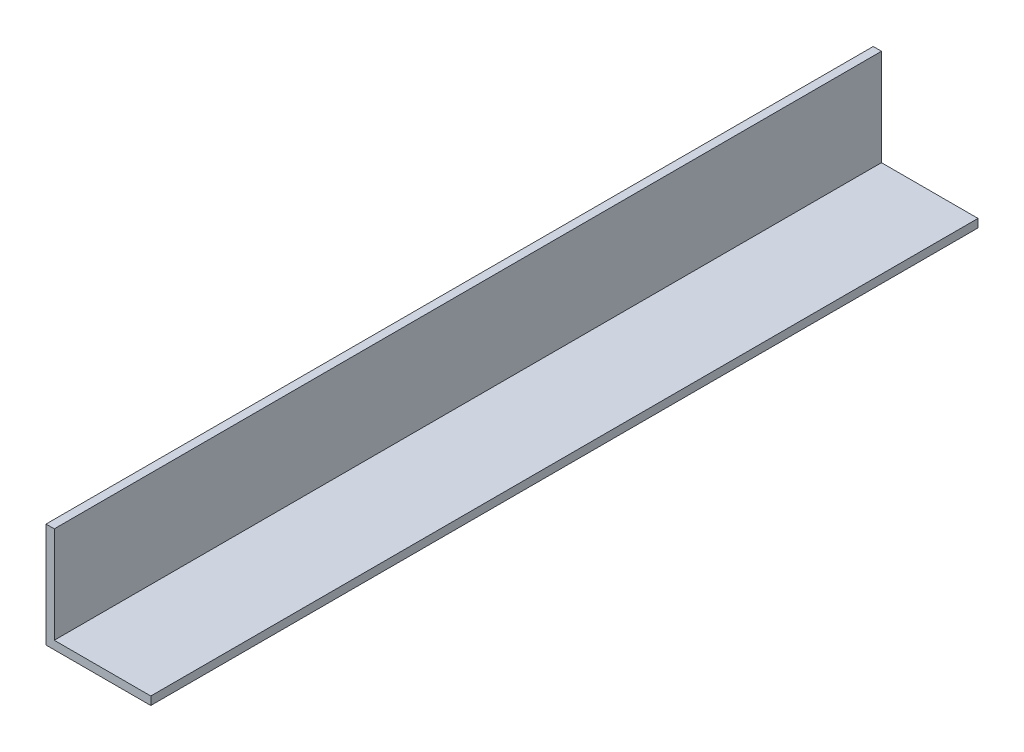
ISO-10303-21;
HEADER;
FILE_DESCRIPTION(('STEP AP214'),'2;1');
FILE_NAME('part.step','',(''),(''),'','','');
FILE_SCHEMA(('AUTOMOTIVE_DESIGN { 1 0 10303 214 1 1 1 1 }'));
ENDSEC;
DATA;
#1=APPLICATION_CONTEXT('core data for automotive mechanical design processes');
#2=APPLICATION_PROTOCOL_DEFINITION('international standard','automotive_design',2000,#1);
#3=PRODUCT_CONTEXT('',#1,'mechanical');
#4=PRODUCT('Part','Part','',(#3));
#5=PRODUCT_RELATED_PRODUCT_CATEGORY('part','',(#4));
#6=PRODUCT_DEFINITION_FORMATION('','',#4);
#7=PRODUCT_DEFINITION_CONTEXT('part definition',#1,'design');
#8=PRODUCT_DEFINITION('design','',#6,#7);
#9=PRODUCT_DEFINITION_SHAPE('','',#8);
#10=(LENGTH_UNIT() NAMED_UNIT(*) SI_UNIT(.MILLI.,.METRE.));
#11=(NAMED_UNIT(*) PLANE_ANGLE_UNIT() SI_UNIT($,.RADIAN.));
#12=(NAMED_UNIT(*) SI_UNIT($,.STERADIAN.) SOLID_ANGLE_UNIT());
#13=UNCERTAINTY_MEASURE_WITH_UNIT(LENGTH_MEASURE(1.E-05),#10,'distance_accuracy_value','');
#14=(GEOMETRIC_REPRESENTATION_CONTEXT(3) GLOBAL_UNCERTAINTY_ASSIGNED_CONTEXT((#13)) GLOBAL_UNIT_ASSIGNED_CONTEXT((#10,
#11,#12)) REPRESENTATION_CONTEXT('',''));
#15=CARTESIAN_POINT('',(0.,0.,0.));
#16=DIRECTION('',(0.,0.,1.));
#17=DIRECTION('',(1.,0.,0.));
#18=AXIS2_PLACEMENT_3D('',#15,#16,#17);
#19=CARTESIAN_POINT('',(38.,0.,150.));
#20=DIRECTION('',(0.,1.,0.));
#21=DIRECTION('',(0.,0.,1.));
#22=AXIS2_PLACEMENT_3D('',#19,#20,#21);
#23=PLANE('',#22);
#24=DIRECTION('',(1.,0.,0.));
#25=VECTOR('',#24,1.);
#26=CARTESIAN_POINT('',(38.,0.,-150.));
#27=LINE('',#26,#25);
#28=CARTESIAN_POINT('',(0.,0.,-150.));
#29=VERTEX_POINT('',#28);
#30=CARTESIAN_POINT('',(38.,0.,-150.));
#31=VERTEX_POINT('',#30);
#32=EDGE_CURVE('E120',#29,#31,#27,.T.);
#33=ORIENTED_EDGE('',*,*,#32,.T.);
#34=DIRECTION('',(0.,0.,-1.));
#35=VECTOR('',#34,1.);
#36=CARTESIAN_POINT('',(38.,0.,150.));
#37=LINE('',#36,#35);
#38=CARTESIAN_POINT('',(38.,0.,150.));
#39=VERTEX_POINT('',#38);
#40=EDGE_CURVE('E11',#39,#31,#37,.T.);
#41=ORIENTED_EDGE('',*,*,#40,.F.);
#42=DIRECTION('',(1.,0.,0.));
#43=VECTOR('',#42,1.);
#44=CARTESIAN_POINT('',(38.,0.,150.));
#45=LINE('',#44,#43);
#46=CARTESIAN_POINT('',(0.,0.,150.));
#47=VERTEX_POINT('',#46);
#48=EDGE_CURVE('E130',#47,#39,#45,.T.);
#49=ORIENTED_EDGE('',*,*,#48,.F.);
#50=DIRECTION('',(0.,0.,-1.));
#51=VECTOR('',#50,1.);
#52=CARTESIAN_POINT('',(0.,0.,150.));
#53=LINE('',#52,#51);
#54=EDGE_CURVE('E116',#47,#29,#53,.T.);
#55=ORIENTED_EDGE('',*,*,#54,.T.);
#56=EDGE_LOOP('',(#33,#41,#49,#55));
#57=FACE_BOUND('',#56,.T.);
#58=ADVANCED_FACE('F36',(#57),#23,.F.);
#59=CARTESIAN_POINT('',(38.,3.,150.));
#60=DIRECTION('',(-1.,0.,0.));
#61=DIRECTION('',(0.,0.,1.));
#62=AXIS2_PLACEMENT_3D('',#59,#60,#61);
#63=PLANE('',#62);
#64=DIRECTION('',(0.,1.,0.));
#65=VECTOR('',#64,1.);
#66=CARTESIAN_POINT('',(38.,3.,-150.));
#67=LINE('',#66,#65);
#68=CARTESIAN_POINT('',(38.,3.,-150.));
#69=VERTEX_POINT('',#68);
#70=EDGE_CURVE('E123',#31,#69,#67,.T.);
#71=ORIENTED_EDGE('',*,*,#70,.T.);
#72=DIRECTION('',(0.,0.,-1.));
#73=VECTOR('',#72,1.);
#74=CARTESIAN_POINT('',(38.,3.,150.));
#75=LINE('',#74,#73);
#76=CARTESIAN_POINT('',(38.,3.,150.));
#77=VERTEX_POINT('',#76);
#78=EDGE_CURVE('E44',#77,#69,#75,.T.);
#79=ORIENTED_EDGE('',*,*,#78,.F.);
#80=DIRECTION('',(0.,1.,0.));
#81=VECTOR('',#80,1.);
#82=CARTESIAN_POINT('',(38.,3.,150.));
#83=LINE('',#82,#81);
#84=EDGE_CURVE('E89',#39,#77,#83,.T.);
#85=ORIENTED_EDGE('',*,*,#84,.F.);
#86=ORIENTED_EDGE('',*,*,#40,.T.);
#87=EDGE_LOOP('',(#71,#79,#85,#86));
#88=FACE_BOUND('',#87,.T.);
#89=ADVANCED_FACE('F154',(#88),#63,.F.);
#90=CARTESIAN_POINT('',(3.,3.,150.));
#91=DIRECTION('',(0.,-1.,0.));
#92=DIRECTION('',(0.,0.,-1.));
#93=AXIS2_PLACEMENT_3D('',#90,#91,#92);
#94=PLANE('',#93);
#95=DIRECTION('',(-1.,0.,0.));
#96=VECTOR('',#95,1.);
#97=CARTESIAN_POINT('',(3.,3.,-150.));
#98=LINE('',#97,#96);
#99=CARTESIAN_POINT('',(3.,3.,-150.));
#100=VERTEX_POINT('',#99);
#101=EDGE_CURVE('E125',#69,#100,#98,.T.);
#102=ORIENTED_EDGE('',*,*,#101,.T.);
#103=DIRECTION('',(0.,0.,-1.));
#104=VECTOR('',#103,1.);
#105=CARTESIAN_POINT('',(3.,3.,150.));
#106=LINE('',#105,#104);
#107=CARTESIAN_POINT('',(3.,3.,150.));
#108=VERTEX_POINT('',#107);
#109=EDGE_CURVE('E111',#108,#100,#106,.T.);
#110=ORIENTED_EDGE('',*,*,#109,.F.);
#111=DIRECTION('',(-1.,0.,0.));
#112=VECTOR('',#111,1.);
#113=CARTESIAN_POINT('',(3.,3.,150.));
#114=LINE('',#113,#112);
#115=EDGE_CURVE('E102',#77,#108,#114,.T.);
#116=ORIENTED_EDGE('',*,*,#115,.F.);
#117=ORIENTED_EDGE('',*,*,#78,.T.);
#118=EDGE_LOOP('',(#102,#110,#116,#117));
#119=FACE_BOUND('',#118,.T.);
#120=ADVANCED_FACE('F136',(#119),#94,.F.);
#121=CARTESIAN_POINT('',(3.,38.,150.));
#122=DIRECTION('',(-1.,0.,0.));
#123=DIRECTION('',(0.,0.,1.));
#124=AXIS2_PLACEMENT_3D('',#121,#122,#123);
#125=PLANE('',#124);
#126=DIRECTION('',(0.,1.,0.));
#127=VECTOR('',#126,1.);
#128=CARTESIAN_POINT('',(3.,38.,-150.));
#129=LINE('',#128,#127);
#130=CARTESIAN_POINT('',(3.,38.,-150.));
#131=VERTEX_POINT('',#130);
#132=EDGE_CURVE('E110',#100,#131,#129,.T.);
#133=ORIENTED_EDGE('',*,*,#132,.T.);
#134=DIRECTION('',(0.,0.,-1.));
#135=VECTOR('',#134,1.);
#136=CARTESIAN_POINT('',(3.,38.,150.));
#137=LINE('',#136,#135);
#138=CARTESIAN_POINT('',(3.,38.,150.));
#139=VERTEX_POINT('',#138);
#140=EDGE_CURVE('E107',#139,#131,#137,.T.);
#141=ORIENTED_EDGE('',*,*,#140,.F.);
#142=DIRECTION('',(0.,1.,0.));
#143=VECTOR('',#142,1.);
#144=CARTESIAN_POINT('',(3.,38.,150.));
#145=LINE('',#144,#143);
#146=EDGE_CURVE('E96',#108,#139,#145,.T.);
#147=ORIENTED_EDGE('',*,*,#146,.F.);
#148=ORIENTED_EDGE('',*,*,#109,.T.);
#149=EDGE_LOOP('',(#133,#141,#147,#148));
#150=FACE_BOUND('',#149,.T.);
#151=ADVANCED_FACE('F108',(#150),#125,.F.);
#152=CARTESIAN_POINT('',(0.,38.,150.));
#153=DIRECTION('',(0.,-1.,0.));
#154=DIRECTION('',(0.,0.,-1.));
#155=AXIS2_PLACEMENT_3D('',#152,#153,#154);
#156=PLANE('',#155);
#157=DIRECTION('',(-1.,0.,0.));
#158=VECTOR('',#157,1.);
#159=CARTESIAN_POINT('',(0.,38.,-150.));
#160=LINE('',#159,#158);
#161=CARTESIAN_POINT('',(0.,38.,-150.));
#162=VERTEX_POINT('',#161);
#163=EDGE_CURVE('E75',#131,#162,#160,.T.);
#164=ORIENTED_EDGE('',*,*,#163,.T.);
#165=DIRECTION('',(0.,0.,-1.));
#166=VECTOR('',#165,1.);
#167=CARTESIAN_POINT('',(0.,38.,150.));
#168=LINE('',#167,#166);
#169=CARTESIAN_POINT('',(0.,38.,150.));
#170=VERTEX_POINT('',#169);
#171=EDGE_CURVE('E112',#170,#162,#168,.T.);
#172=ORIENTED_EDGE('',*,*,#171,.F.);
#173=DIRECTION('',(-1.,0.,0.));
#174=VECTOR('',#173,1.);
#175=CARTESIAN_POINT('',(0.,38.,150.));
#176=LINE('',#175,#174);
#177=EDGE_CURVE('E100',#139,#170,#176,.T.);
#178=ORIENTED_EDGE('',*,*,#177,.F.);
#179=ORIENTED_EDGE('',*,*,#140,.T.);
#180=EDGE_LOOP('',(#164,#172,#178,#179));
#181=FACE_BOUND('',#180,.T.);
#182=ADVANCED_FACE('F114',(#181),#156,.F.);
#183=CARTESIAN_POINT('',(0.,0.,150.));
#184=DIRECTION('',(1.,0.,0.));
#185=DIRECTION('',(0.,0.,-1.));
#186=AXIS2_PLACEMENT_3D('',#183,#184,#185);
#187=PLANE('',#186);
#188=DIRECTION('',(0.,-1.,0.));
#189=VECTOR('',#188,1.);
#190=CARTESIAN_POINT('',(0.,0.,-150.));
#191=LINE('',#190,#189);
#192=EDGE_CURVE('E81',#162,#29,#191,.T.);
#193=ORIENTED_EDGE('',*,*,#192,.T.);
#194=ORIENTED_EDGE('',*,*,#54,.F.);
#195=DIRECTION('',(0.,-1.,0.));
#196=VECTOR('',#195,1.);
#197=CARTESIAN_POINT('',(0.,0.,150.));
#198=LINE('',#197,#196);
#199=EDGE_CURVE('E52',#170,#47,#198,.T.);
#200=ORIENTED_EDGE('',*,*,#199,.F.);
#201=ORIENTED_EDGE('',*,*,#171,.T.);
#202=EDGE_LOOP('',(#193,#194,#200,#201));
#203=FACE_BOUND('',#202,.T.);
#204=ADVANCED_FACE('F143',(#203),#187,.F.);
#205=CARTESIAN_POINT('',(0.,0.,150.));
#206=DIRECTION('',(0.,0.,-1.));
#207=DIRECTION('',(-1.,0.,0.));
#208=AXIS2_PLACEMENT_3D('',#205,#206,#207);
#209=PLANE('',#208);
#210=ORIENTED_EDGE('',*,*,#48,.T.);
#211=ORIENTED_EDGE('',*,*,#84,.T.);
#212=ORIENTED_EDGE('',*,*,#115,.T.);
#213=ORIENTED_EDGE('',*,*,#146,.T.);
#214=ORIENTED_EDGE('',*,*,#177,.T.);
#215=ORIENTED_EDGE('',*,*,#199,.T.);
#216=EDGE_LOOP('',(#210,#211,#212,#213,#214,#215));
#217=FACE_BOUND('',#216,.T.);
#218=ADVANCED_FACE('F98',(#217),#209,.F.);
#219=CARTESIAN_POINT('',(0.,0.,-150.));
#220=DIRECTION('',(0.,0.,-1.));
#221=DIRECTION('',(-1.,0.,0.));
#222=AXIS2_PLACEMENT_3D('',#219,#220,#221);
#223=PLANE('',#222);
#224=ORIENTED_EDGE('',*,*,#32,.F.);
#225=ORIENTED_EDGE('',*,*,#192,.F.);
#226=ORIENTED_EDGE('',*,*,#163,.F.);
#227=ORIENTED_EDGE('',*,*,#132,.F.);
#228=ORIENTED_EDGE('',*,*,#101,.F.);
#229=ORIENTED_EDGE('',*,*,#70,.F.);
#230=EDGE_LOOP('',(#224,#225,#226,#227,#228,#229));
#231=FACE_BOUND('',#230,.T.);
#232=ADVANCED_FACE('F139',(#231),#223,.T.);
#233=CLOSED_SHELL('',(#58,#89,#120,#151,#182,#204,#218,#232));
#234=MANIFOLD_SOLID_BREP('B2',#233);
#235=ADVANCED_BREP_SHAPE_REPRESENTATION('',(#18,#234),#14);
#236=SHAPE_DEFINITION_REPRESENTATION(#9,#235);
ENDSEC;
END-ISO-10303-21;
